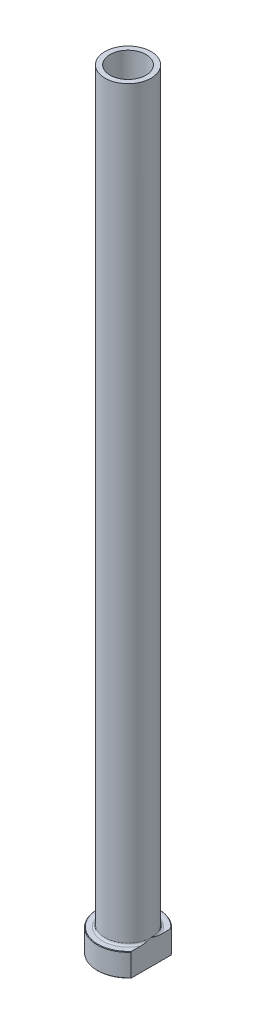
ISO-10303-21;
HEADER;
FILE_DESCRIPTION(('STEP AP214'),'2;1');
FILE_NAME('part.step','',(''),(''),'','','');
FILE_SCHEMA(('AUTOMOTIVE_DESIGN { 1 0 10303 214 1 1 1 1 }'));
ENDSEC;
DATA;
#1=APPLICATION_CONTEXT('core data for automotive mechanical design processes');
#2=APPLICATION_PROTOCOL_DEFINITION('international standard','automotive_design',2000,#1);
#3=PRODUCT_CONTEXT('',#1,'mechanical');
#4=PRODUCT('Part','Part','',(#3));
#5=PRODUCT_RELATED_PRODUCT_CATEGORY('part','',(#4));
#6=PRODUCT_DEFINITION_FORMATION('','',#4);
#7=PRODUCT_DEFINITION_CONTEXT('part definition',#1,'design');
#8=PRODUCT_DEFINITION('design','',#6,#7);
#9=PRODUCT_DEFINITION_SHAPE('','',#8);
#10=(LENGTH_UNIT() NAMED_UNIT(*) SI_UNIT(.MILLI.,.METRE.));
#11=(NAMED_UNIT(*) PLANE_ANGLE_UNIT() SI_UNIT($,.RADIAN.));
#12=(NAMED_UNIT(*) SI_UNIT($,.STERADIAN.) SOLID_ANGLE_UNIT());
#13=UNCERTAINTY_MEASURE_WITH_UNIT(LENGTH_MEASURE(1.E-05),#10,'distance_accuracy_value','');
#14=(GEOMETRIC_REPRESENTATION_CONTEXT(3) GLOBAL_UNCERTAINTY_ASSIGNED_CONTEXT((#13)) GLOBAL_UNIT_ASSIGNED_CONTEXT((#10,
#11,#12)) REPRESENTATION_CONTEXT('',''));
#15=CARTESIAN_POINT('',(0.,0.,0.));
#16=DIRECTION('',(0.,0.,1.));
#17=DIRECTION('',(1.,0.,0.));
#18=AXIS2_PLACEMENT_3D('',#15,#16,#17);
#19=CARTESIAN_POINT('',(0.,92.1876809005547,0.));
#20=DIRECTION('',(0.,1.,0.));
#21=DIRECTION('',(0.,0.,1.));
#22=AXIS2_PLACEMENT_3D('',#19,#20,#21);
#23=CYLINDRICAL_SURFACE('',#22,7.00000000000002);
#24=CARTESIAN_POINT('',(0.,300.,0.));
#25=DIRECTION('',(0.,1.,0.));
#26=DIRECTION('',(0.,0.,1.));
#27=AXIS2_PLACEMENT_3D('',#24,#25,#26);
#28=CIRCLE('',#27,7.00000000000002);
#29=CARTESIAN_POINT('',(0.,300.,7.00000000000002));
#30=VERTEX_POINT('',#29);
#31=EDGE_CURVE('E167',#30,#30,#28,.T.);
#32=ORIENTED_EDGE('',*,*,#31,.T.);
#33=EDGE_LOOP('',(#32));
#34=FACE_BOUND('',#33,.T.);
#35=CARTESIAN_POINT('',(0.,245.,0.));
#36=DIRECTION('',(0.,1.,0.));
#37=DIRECTION('',(0.,0.,1.));
#38=AXIS2_PLACEMENT_3D('',#35,#36,#37);
#39=CIRCLE('',#38,7.00000000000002);
#40=CARTESIAN_POINT('',(0.,245.,7.00000000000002));
#41=VERTEX_POINT('',#40);
#42=EDGE_CURVE('E170',#41,#41,#39,.T.);
#43=ORIENTED_EDGE('',*,*,#42,.F.);
#44=EDGE_LOOP('',(#43));
#45=FACE_BOUND('',#44,.T.);
#46=ADVANCED_FACE('F32',(#34,#45),#23,.F.);
#47=CARTESIAN_POINT('',(-7.00000000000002,300.,0.));
#48=DIRECTION('',(0.,1.,0.));
#49=DIRECTION('',(0.,0.,1.));
#50=AXIS2_PLACEMENT_3D('',#47,#48,#49);
#51=PLANE('',#50);
#52=CARTESIAN_POINT('',(0.,300.,0.));
#53=DIRECTION('',(0.,1.,0.));
#54=DIRECTION('',(0.,0.,1.));
#55=AXIS2_PLACEMENT_3D('',#52,#53,#54);
#56=CIRCLE('',#55,9.00000000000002);
#57=CARTESIAN_POINT('',(0.,300.,9.00000000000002));
#58=VERTEX_POINT('',#57);
#59=EDGE_CURVE('E174',#58,#58,#56,.T.);
#60=ORIENTED_EDGE('',*,*,#59,.T.);
#61=EDGE_LOOP('',(#60));
#62=FACE_BOUND('',#61,.T.);
#63=ORIENTED_EDGE('',*,*,#31,.F.);
#64=EDGE_LOOP('',(#63));
#65=FACE_BOUND('',#64,.T.);
#66=ADVANCED_FACE('F157',(#62,#65),#51,.T.);
#67=CARTESIAN_POINT('',(0.,92.1876809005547,0.));
#68=DIRECTION('',(0.,1.,0.));
#69=DIRECTION('',(0.,0.,1.));
#70=AXIS2_PLACEMENT_3D('',#67,#68,#69);
#71=CYLINDRICAL_SURFACE('',#70,9.00000000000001);
#72=CARTESIAN_POINT('',(0.,9.8,0.));
#73=DIRECTION('',(0.,1.,0.));
#74=DIRECTION('',(0.,0.,1.));
#75=AXIS2_PLACEMENT_3D('',#72,#73,#74);
#76=CIRCLE('',#75,9.00000000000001);
#77=CARTESIAN_POINT('',(9.,9.8,0.));
#78=VERTEX_POINT('',#77);
#79=EDGE_CURVE('E180',#78,#78,#76,.T.);
#80=ORIENTED_EDGE('',*,*,#79,.T.);
#81=EDGE_LOOP('',(#80));
#82=FACE_BOUND('',#81,.T.);
#83=ORIENTED_EDGE('',*,*,#59,.F.);
#84=EDGE_LOOP('',(#83));
#85=FACE_BOUND('',#84,.T.);
#86=ADVANCED_FACE('F162',(#82,#85),#71,.T.);
#87=CARTESIAN_POINT('',(-8.99999999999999,9.,0.));
#88=DIRECTION('',(0.,1.,0.));
#89=DIRECTION('',(0.,0.,1.));
#90=AXIS2_PLACEMENT_3D('',#87,#88,#89);
#91=PLANE('',#90);
#92=DIRECTION('',(0.,0.,1.));
#93=VECTOR('',#92,1.);
#94=CARTESIAN_POINT('',(9.,9.,0.));
#95=LINE('',#94,#93);
#96=CARTESIAN_POINT('',(9.,9.,-7.63151361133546));
#97=VERTEX_POINT('',#96);
#98=CARTESIAN_POINT('',(9.,9.,-3.87814388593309));
#99=VERTEX_POINT('',#98);
#100=EDGE_CURVE('E54',#97,#99,#95,.T.);
#101=ORIENTED_EDGE('',*,*,#100,.F.);
#102=CARTESIAN_POINT('',(0.,9.,0.));
#103=DIRECTION('',(0.,1.,0.));
#104=DIRECTION('',(0.,0.,1.));
#105=AXIS2_PLACEMENT_3D('',#102,#103,#104);
#106=CIRCLE('',#105,11.7999999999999);
#107=CARTESIAN_POINT('',(8.99999999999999,9.,7.63151361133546));
#108=VERTEX_POINT('',#107);
#109=EDGE_CURVE('E186',#97,#108,#106,.T.);
#110=ORIENTED_EDGE('',*,*,#109,.T.);
#111=CARTESIAN_POINT('',(9.,9.,3.87814388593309));
#112=VERTEX_POINT('',#111);
#113=EDGE_CURVE('E134',#112,#108,#95,.T.);
#114=ORIENTED_EDGE('',*,*,#113,.F.);
#115=CARTESIAN_POINT('',(0.,9.,0.));
#116=DIRECTION('',(0.,1.,0.));
#117=DIRECTION('',(0.,0.,1.));
#118=AXIS2_PLACEMENT_3D('',#115,#116,#117);
#119=CIRCLE('',#118,9.80000000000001);
#120=EDGE_CURVE('E183',#112,#99,#119,.F.);
#121=ORIENTED_EDGE('',*,*,#120,.T.);
#122=EDGE_LOOP('',(#101,#110,#114,#121));
#123=FACE_BOUND('',#122,.T.);
#124=ADVANCED_FACE('F197',(#123),#91,.T.);
#125=CARTESIAN_POINT('',(0.,92.1876809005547,0.));
#126=DIRECTION('',(0.,1.,0.));
#127=DIRECTION('',(0.,0.,1.));
#128=AXIS2_PLACEMENT_3D('',#125,#126,#127);
#129=CYLINDRICAL_SURFACE('',#128,12.);
#130=DIRECTION('',(0.,-1.,0.));
#131=VECTOR('',#130,1.);
#132=CARTESIAN_POINT('',(8.99999999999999,300.,7.93725393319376));
#133=LINE('',#132,#131);
#134=CARTESIAN_POINT('',(8.99999999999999,8.79999999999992,7.93725393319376));
#135=VERTEX_POINT('',#134);
#136=CARTESIAN_POINT('',(8.99999999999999,0.200000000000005,7.93725393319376));
#137=VERTEX_POINT('',#136);
#138=EDGE_CURVE('E82',#135,#137,#133,.T.);
#139=ORIENTED_EDGE('',*,*,#138,.F.);
#140=CARTESIAN_POINT('',(0.,8.79999999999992,0.));
#141=DIRECTION('',(0.,1.,0.));
#142=DIRECTION('',(0.,0.,1.));
#143=AXIS2_PLACEMENT_3D('',#140,#141,#142);
#144=CIRCLE('',#143,12.);
#145=CARTESIAN_POINT('',(9.,8.79999999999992,-7.93725393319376));
#146=VERTEX_POINT('',#145);
#147=EDGE_CURVE('E95',#135,#146,#144,.F.);
#148=ORIENTED_EDGE('',*,*,#147,.T.);
#149=DIRECTION('',(0.,-1.,0.));
#150=VECTOR('',#149,1.);
#151=CARTESIAN_POINT('',(9.,300.,-7.93725393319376));
#152=LINE('',#151,#150);
#153=CARTESIAN_POINT('',(9.,0.200000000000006,-7.93725393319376));
#154=VERTEX_POINT('',#153);
#155=EDGE_CURVE('E192',#146,#154,#152,.T.);
#156=ORIENTED_EDGE('',*,*,#155,.T.);
#157=CARTESIAN_POINT('',(0.,0.200000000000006,0.));
#158=DIRECTION('',(0.,-1.,0.));
#159=DIRECTION('',(0.,0.,-1.));
#160=AXIS2_PLACEMENT_3D('',#157,#158,#159);
#161=CIRCLE('',#160,12.);
#162=EDGE_CURVE('E98',#154,#137,#161,.F.);
#163=ORIENTED_EDGE('',*,*,#162,.T.);
#164=EDGE_LOOP('',(#139,#148,#156,#163));
#165=FACE_BOUND('',#164,.T.);
#166=ADVANCED_FACE('F190',(#165),#129,.T.);
#167=CARTESIAN_POINT('',(-12.,0.,0.));
#168=DIRECTION('',(0.,-1.,0.));
#169=DIRECTION('',(0.,0.,-1.));
#170=AXIS2_PLACEMENT_3D('',#167,#168,#169);
#171=PLANE('',#170);
#172=CARTESIAN_POINT('',(0.,0.,0.));
#173=DIRECTION('',(0.,-1.,0.));
#174=DIRECTION('',(0.,0.,-1.));
#175=AXIS2_PLACEMENT_3D('',#172,#173,#174);
#176=CIRCLE('',#175,7.74999999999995);
#177=CARTESIAN_POINT('',(0.,0.,-7.74999999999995));
#178=VERTEX_POINT('',#177);
#179=EDGE_CURVE('E40',#178,#178,#176,.F.);
#180=ORIENTED_EDGE('',*,*,#179,.T.);
#181=EDGE_LOOP('',(#180));
#182=FACE_BOUND('',#181,.T.);
#183=DIRECTION('',(0.,0.,-1.));
#184=VECTOR('',#183,1.);
#185=CARTESIAN_POINT('',(8.99999999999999,0.,7.93725393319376));
#186=LINE('',#185,#184);
#187=CARTESIAN_POINT('',(8.99999999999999,0.,7.63151361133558));
#188=VERTEX_POINT('',#187);
#189=CARTESIAN_POINT('',(9.,0.,-7.63151361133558));
#190=VERTEX_POINT('',#189);
#191=EDGE_CURVE('E47',#188,#190,#186,.T.);
#192=ORIENTED_EDGE('',*,*,#191,.F.);
#193=CARTESIAN_POINT('',(0.,0.,0.));
#194=DIRECTION('',(0.,-1.,0.));
#195=DIRECTION('',(0.,0.,-1.));
#196=AXIS2_PLACEMENT_3D('',#193,#194,#195);
#197=CIRCLE('',#196,11.8);
#198=EDGE_CURVE('E92',#188,#190,#197,.T.);
#199=ORIENTED_EDGE('',*,*,#198,.T.);
#200=EDGE_LOOP('',(#192,#199));
#201=FACE_BOUND('',#200,.T.);
#202=ADVANCED_FACE('F91',(#182,#201),#171,.T.);
#203=CARTESIAN_POINT('',(0.,92.1876809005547,0.));
#204=DIRECTION('',(0.,1.,0.));
#205=DIRECTION('',(0.,0.,1.));
#206=AXIS2_PLACEMENT_3D('',#203,#204,#205);
#207=CYLINDRICAL_SURFACE('',#206,7.25);
#208=CARTESIAN_POINT('',(0.,0.499999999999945,0.));
#209=DIRECTION('',(0.,-1.,0.));
#210=DIRECTION('',(0.,0.,-1.));
#211=AXIS2_PLACEMENT_3D('',#208,#209,#210);
#212=CIRCLE('',#211,7.25);
#213=CARTESIAN_POINT('',(0.,0.499999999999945,-7.25));
#214=VERTEX_POINT('',#213);
#215=EDGE_CURVE('E11',#214,#214,#212,.T.);
#216=ORIENTED_EDGE('',*,*,#215,.T.);
#217=EDGE_LOOP('',(#216));
#218=FACE_BOUND('',#217,.T.);
#219=CARTESIAN_POINT('',(0.,233.,0.));
#220=DIRECTION('',(0.,1.,0.));
#221=DIRECTION('',(0.,0.,1.));
#222=AXIS2_PLACEMENT_3D('',#219,#220,#221);
#223=CIRCLE('',#222,7.25000000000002);
#224=CARTESIAN_POINT('',(0.,233.,7.25000000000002));
#225=VERTEX_POINT('',#224);
#226=EDGE_CURVE('E172',#225,#225,#223,.T.);
#227=ORIENTED_EDGE('',*,*,#226,.T.);
#228=EDGE_LOOP('',(#227));
#229=FACE_BOUND('',#228,.T.);
#230=ADVANCED_FACE('F215',(#218,#229),#207,.F.);
#231=CARTESIAN_POINT('',(0.,233.,0.));
#232=DIRECTION('',(0.,-1.,0.));
#233=DIRECTION('',(0.,0.,-1.));
#234=AXIS2_PLACEMENT_3D('',#231,#232,#233);
#235=CONICAL_SURFACE('',#234,7.25000000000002,0.0208303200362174);
#236=ORIENTED_EDGE('',*,*,#42,.T.);
#237=EDGE_LOOP('',(#236));
#238=FACE_BOUND('',#237,.T.);
#239=ORIENTED_EDGE('',*,*,#226,.F.);
#240=EDGE_LOOP('',(#239));
#241=FACE_BOUND('',#240,.T.);
#242=ADVANCED_FACE('F111',(#238,#241),#235,.F.);
#243=CARTESIAN_POINT('',(0.,9.8,0.));
#244=DIRECTION('',(0.,1.,0.));
#245=DIRECTION('',(0.,0.,1.));
#246=AXIS2_PLACEMENT_3D('',#243,#244,#245);
#247=TOROIDAL_SURFACE('',#246,9.80000000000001,0.8);
#248=ORIENTED_EDGE('',*,*,#120,.F.);
#249=CARTESIAN_POINT('',(9.,9.8,0.));
#250=CARTESIAN_POINT('',(9.,9.80000101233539,-6.4683805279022E-11));
#251=CARTESIAN_POINT('',(9.,9.80000202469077,3.17332584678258E-07));
#252=CARTESIAN_POINT('',(9.,9.80000393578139,1.24154750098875E-06));
#253=CARTESIAN_POINT('',(9.,9.80000482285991,1.86583060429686E-06));
#254=CARTESIAN_POINT('',(9.,9.80000663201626,3.35641339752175E-06));
#255=CARTESIAN_POINT('',(9.,9.80000753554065,4.24567417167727E-06));
#256=CARTESIAN_POINT('',(9.,9.80000918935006,6.11612227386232E-06));
#257=CARTESIAN_POINT('',(9.,9.80000994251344,7.09492055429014E-06));
#258=CARTESIAN_POINT('',(9.,9.80001263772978,1.0780271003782E-05));
#259=CARTESIAN_POINT('',(9.,9.80001442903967,1.36008599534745E-05));
#260=CARTESIAN_POINT('',(9.,9.80001746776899,1.92722544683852E-05));
#261=CARTESIAN_POINT('',(9.,9.80001874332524,2.21087228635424E-05));
#262=CARTESIAN_POINT('',(9.,9.80002390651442,3.37975055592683E-05));
#263=CARTESIAN_POINT('',(9.,9.80002763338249,4.27293190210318E-05));
#264=CARTESIAN_POINT('',(9.,9.80003330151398,5.98324831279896E-05));
#265=CARTESIAN_POINT('',(9.,9.80003541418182,6.79472980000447E-05));
#266=CARTESIAN_POINT('',(9.00000000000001,9.80005049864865,0.000127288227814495));
#267=CARTESIAN_POINT('',(9.,9.80006163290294,0.000178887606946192));
#268=CARTESIAN_POINT('',(8.99999999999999,9.800110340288,0.000381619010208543));
#269=CARTESIAN_POINT('',(8.99999999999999,9.8001571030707,0.000530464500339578));
#270=CARTESIAN_POINT('',(9.00000000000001,9.80033804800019,0.00111728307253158));
#271=CARTESIAN_POINT('',(9.,9.80046603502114,0.00155660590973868));
#272=CARTESIAN_POINT('',(8.99999999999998,9.80097635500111,0.00329406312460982));
#273=CARTESIAN_POINT('',(8.99999999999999,9.8013663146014,0.00459050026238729));
#274=CARTESIAN_POINT('',(9.00000000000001,9.80298403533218,0.00998416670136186));
#275=CARTESIAN_POINT('',(9.00000000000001,9.80420236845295,0.014083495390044));
#276=CARTESIAN_POINT('',(8.99999999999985,9.82648661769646,0.0890427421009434));
#277=CARTESIAN_POINT('',(8.99999999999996,9.8476462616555,0.159882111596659));
#278=CARTESIAN_POINT('',(9.00000000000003,9.8889590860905,0.298764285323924));
#279=CARTESIAN_POINT('',(9.00000000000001,9.90911860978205,0.366805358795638));
#280=CARTESIAN_POINT('',(8.99999999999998,9.95179311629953,0.51152451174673));
#281=CARTESIAN_POINT('',(8.99999999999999,9.97428452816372,0.588209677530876));
#282=CARTESIAN_POINT('',(9.,10.0191408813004,0.742532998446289));
#283=CARTESIAN_POINT('',(9.,10.0415017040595,0.820172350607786));
#284=CARTESIAN_POINT('',(9.,10.0794112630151,0.953448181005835));
#285=CARTESIAN_POINT('',(9.,10.0950851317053,1.00904901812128));
#286=CARTESIAN_POINT('',(9.,10.1260784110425,1.1201953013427));
#287=CARTESIAN_POINT('',(9.,10.1413986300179,1.17574052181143));
#288=CARTESIAN_POINT('',(9.,10.1860703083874,1.33980716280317));
#289=CARTESIAN_POINT('',(9.,10.2149083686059,1.4484686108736));
#290=CARTESIAN_POINT('',(9.,10.2856369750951,1.7241783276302));
#291=CARTESIAN_POINT('',(9.,10.3263124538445,1.89154391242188));
#292=CARTESIAN_POINT('',(9.,10.4020454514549,2.22904779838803));
#293=CARTESIAN_POINT('',(9.,10.4370523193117,2.39919757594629));
#294=CARTESIAN_POINT('',(9.,10.5014391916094,2.75494052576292));
#295=CARTESIAN_POINT('',(9.,10.5301301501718,2.94066439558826));
#296=CARTESIAN_POINT('',(9.,10.5633122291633,3.22016202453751));
#297=CARTESIAN_POINT('',(9.,10.5727244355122,3.31335338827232));
#298=CARTESIAN_POINT('',(9.,10.5877042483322,3.50003892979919));
#299=CARTESIAN_POINT('',(9.,10.5932725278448,3.59353305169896));
#300=CARTESIAN_POINT('',(9.,10.5997812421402,3.77831079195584));
#301=CARTESIAN_POINT('',(9.,10.6008358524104,3.86959010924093));
#302=CARTESIAN_POINT('',(9.,10.5977997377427,4.0521529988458));
#303=CARTESIAN_POINT('',(8.99999999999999,10.5937049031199,4.14343651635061));
#304=CARTESIAN_POINT('',(8.99999999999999,10.579384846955,4.32415905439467));
#305=CARTESIAN_POINT('',(8.99999999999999,10.5692536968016,4.41360502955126));
#306=CARTESIAN_POINT('',(8.99999999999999,10.5415393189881,4.59125765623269));
#307=CARTESIAN_POINT('',(8.99999999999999,10.5239649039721,4.67946564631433));
#308=CARTESIAN_POINT('',(8.99999999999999,10.4790565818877,4.85471882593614));
#309=CARTESIAN_POINT('',(8.99999999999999,10.4516029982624,4.94173554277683));
#310=CARTESIAN_POINT('',(8.99999999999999,10.4007972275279,5.06830195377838));
#311=CARTESIAN_POINT('',(8.99999999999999,10.3822808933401,5.10979172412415));
#312=CARTESIAN_POINT('',(8.99999999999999,10.3414775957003,5.19085457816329));
#313=CARTESIAN_POINT('',(8.99999999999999,10.3191952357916,5.23042992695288));
#314=CARTESIAN_POINT('',(8.99999999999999,10.2750362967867,5.29920261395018));
#315=CARTESIAN_POINT('',(8.99999999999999,10.2539514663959,5.32890420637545));
#316=CARTESIAN_POINT('',(8.99999999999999,10.2085010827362,5.38577147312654));
#317=CARTESIAN_POINT('',(8.99999999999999,10.1841327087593,5.41293493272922));
#318=CARTESIAN_POINT('',(8.99999999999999,10.1314615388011,5.46389233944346));
#319=CARTESIAN_POINT('',(8.99999999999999,10.1031152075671,5.4876421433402));
#320=CARTESIAN_POINT('',(8.99999999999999,10.0426124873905,5.52966859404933));
#321=CARTESIAN_POINT('',(8.99999999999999,10.010467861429,5.54796155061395));
#322=CARTESIAN_POINT('',(8.99999999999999,9.95377518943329,5.57238639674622));
#323=CARTESIAN_POINT('',(8.99999999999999,9.93009823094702,5.58053697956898));
#324=CARTESIAN_POINT('',(8.99999999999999,9.88171464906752,5.59278453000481));
#325=CARTESIAN_POINT('',(8.99999999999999,9.85700894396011,5.59688503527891));
#326=CARTESIAN_POINT('',(8.99999999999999,9.80717489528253,5.60067699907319));
#327=CARTESIAN_POINT('',(8.99999999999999,9.78204544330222,5.60035415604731));
#328=CARTESIAN_POINT('',(8.99999999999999,9.73223420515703,5.59529565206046));
#329=CARTESIAN_POINT('',(8.99999999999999,9.70755259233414,5.59055831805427));
#330=CARTESIAN_POINT('',(8.99999999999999,9.66020362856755,5.57733425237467));
#331=CARTESIAN_POINT('',(8.99999999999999,9.63749568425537,5.5689898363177));
#332=CARTESIAN_POINT('',(8.99999999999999,9.59351516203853,5.54915687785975));
#333=CARTESIAN_POINT('',(8.99999999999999,9.57224307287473,5.53766727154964));
#334=CARTESIAN_POINT('',(8.99999999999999,9.51928150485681,5.50462580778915));
#335=CARTESIAN_POINT('',(8.99999999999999,9.48880776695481,5.48112661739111));
#336=CARTESIAN_POINT('',(8.99999999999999,9.43189052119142,5.42965338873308));
#337=CARTESIAN_POINT('',(8.99999999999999,9.40546009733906,5.40166539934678));
#338=CARTESIAN_POINT('',(8.99999999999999,9.3400555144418,5.32319042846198));
#339=CARTESIAN_POINT('',(8.99999999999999,9.30430472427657,5.2700386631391));
#340=CARTESIAN_POINT('',(8.99999999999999,9.24095813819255,5.1592639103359));
#341=CARTESIAN_POINT('',(8.99999999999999,9.21336826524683,5.10163771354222));
#342=CARTESIAN_POINT('',(8.99999999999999,9.16551403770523,4.98579619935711));
#343=CARTESIAN_POINT('',(8.99999999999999,9.1450293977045,4.92767012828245));
#344=CARTESIAN_POINT('',(8.99999999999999,9.10900516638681,4.80987690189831));
#345=CARTESIAN_POINT('',(8.99999999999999,9.0934705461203,4.75020826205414));
#346=CARTESIAN_POINT('',(8.99999999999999,9.06639912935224,4.62926355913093));
#347=CARTESIAN_POINT('',(8.99999999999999,9.05491059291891,4.56797688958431));
#348=CARTESIAN_POINT('',(8.99999999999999,9.03554988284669,4.44488746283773));
#349=CARTESIAN_POINT('',(8.99999999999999,9.02767548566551,4.38308504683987));
#350=CARTESIAN_POINT('',(8.99999999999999,9.01237706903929,4.23320098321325));
#351=CARTESIAN_POINT('',(8.99999999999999,9.00652460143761,4.14495990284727));
#352=CARTESIAN_POINT('',(8.99999999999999,8.99996624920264,3.9682712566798));
#353=CARTESIAN_POINT('',(9.,8.99926276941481,3.87982361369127));
#354=CARTESIAN_POINT('',(9.,9.00218728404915,3.70272096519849));
#355=CARTESIAN_POINT('',(9.,9.00582939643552,3.6140662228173));
#356=CARTESIAN_POINT('',(9.,9.01681466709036,3.43698088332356));
#357=CARTESIAN_POINT('',(9.,9.02415848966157,3.34855032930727));
#358=CARTESIAN_POINT('',(9.,9.04989749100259,3.09391807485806));
#359=CARTESIAN_POINT('',(9.,9.0723219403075,2.92812217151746));
#360=CARTESIAN_POINT('',(9.,9.12539895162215,2.59921508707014));
#361=CARTESIAN_POINT('',(9.,9.1559872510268,2.43609307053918));
#362=CARTESIAN_POINT('',(9.,9.22330285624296,2.11182788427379));
#363=CARTESIAN_POINT('',(9.,9.26000471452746,1.95067936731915));
#364=CARTESIAN_POINT('',(9.,9.31897632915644,1.70786584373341));
#365=CARTESIAN_POINT('',(9.,9.33955107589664,1.62578051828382));
#366=CARTESIAN_POINT('',(9.,9.38177259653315,1.46165638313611));
#367=CARTESIAN_POINT('',(9.,9.40342203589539,1.37961825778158));
#368=CARTESIAN_POINT('',(9.,9.45602430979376,1.18435079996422));
#369=CARTESIAN_POINT('',(9.,9.48736095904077,1.07122519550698));
#370=CARTESIAN_POINT('',(9.,9.55083956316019,0.846545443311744));
#371=CARTESIAN_POINT('',(9.,9.58296886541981,0.734987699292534));
#372=CARTESIAN_POINT('',(9.,9.64431039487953,0.524609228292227));
#373=CARTESIAN_POINT('',(9.,9.67344475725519,0.42576576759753));
#374=CARTESIAN_POINT('',(9.,9.71808680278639,0.275077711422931));
#375=CARTESIAN_POINT('',(8.99999999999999,9.73349584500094,0.223203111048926));
#376=CARTESIAN_POINT('',(9.,9.76415269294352,0.120285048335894));
#377=CARTESIAN_POINT('',(9.00000000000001,9.77939925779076,0.0692412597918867));
#378=CARTESIAN_POINT('',(9.,9.79579831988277,0.0140813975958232));
#379=CARTESIAN_POINT('',(8.99999999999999,9.79701722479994,0.00997994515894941));
#380=CARTESIAN_POINT('',(9.,9.79863508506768,0.00458578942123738));
#381=CARTESIAN_POINT('',(9.,9.79902455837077,0.00329097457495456));
#382=CARTESIAN_POINT('',(9.,9.79953428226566,0.00155554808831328));
#383=CARTESIAN_POINT('',(8.99999999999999,9.79966215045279,0.00111663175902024));
#384=CARTESIAN_POINT('',(9.,9.79984295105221,0.000530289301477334));
#385=CARTESIAN_POINT('',(9.,9.7998896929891,0.000381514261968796));
#386=CARTESIAN_POINT('',(9.,9.79993838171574,0.000178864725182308));
#387=CARTESIAN_POINT('',(9.,9.79994951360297,0.000127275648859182));
#388=CARTESIAN_POINT('',(9.,9.79996459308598,6.7945137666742E-05));
#389=CARTESIAN_POINT('',(9.,9.79996670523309,5.98309339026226E-05));
#390=CARTESIAN_POINT('',(9.,9.79997237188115,4.27289867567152E-05));
#391=CARTESIAN_POINT('',(9.,9.79997609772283,3.37977473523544E-05));
#392=CARTESIAN_POINT('',(9.,9.79998125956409,2.21095467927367E-05));
#393=CARTESIAN_POINT('',(9.,9.79998253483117,1.92731239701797E-05));
#394=CARTESIAN_POINT('',(9.,9.79998557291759,1.36017696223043E-05));
#395=CARTESIAN_POINT('',(9.,9.79998736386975,1.07811702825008E-05));
#396=CARTESIAN_POINT('',(9.,9.79999005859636,7.09574547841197E-06));
#397=CARTESIAN_POINT('',(9.,9.79999081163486,6.11691225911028E-06));
#398=CARTESIAN_POINT('',(9.,9.79999246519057,4.2463717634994E-06));
#399=CARTESIAN_POINT('',(9.,9.79999336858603,3.35705295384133E-06));
#400=CARTESIAN_POINT('',(9.,9.79999517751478,1.86633217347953E-06));
#401=CARTESIAN_POINT('',(9.,9.79999606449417,1.24197357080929E-06));
#402=CARTESIAN_POINT('',(9.,9.79999797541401,3.17571007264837E-07));
#403=CARTESIAN_POINT('',(9.,9.79999898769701,6.46856694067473E-11));
#404=CARTESIAN_POINT('',(9.,9.8,0.));
#405=B_SPLINE_CURVE_WITH_KNOTS('',3,(#249,#250,#251,#252,#253,#254,#255,#256,#257,#258,#259,
#260,#261,#262,#263,#264,#265,#266,#267,#268,#269,#270,#271,#272,#273,#274,#275,#276,#277,#278,
#279,#280,#281,#282,#283,#284,#285,#286,#287,#288,#289,#290,#291,#292,#293,#294,#295,#296,#297,
#298,#299,#300,#301,#302,#303,#304,#305,#306,#307,#308,#309,#310,#311,#312,#313,#314,#315,#316,
#317,#318,#319,#320,#321,#322,#323,#324,#325,#326,#327,#328,#329,#330,#331,#332,#333,#334,#335,
#336,#337,#338,#339,#340,#341,#342,#343,#344,#345,#346,#347,#348,#349,#350,#351,#352,#353,#354,
#355,#356,#357,#358,#359,#360,#361,#362,#363,#364,#365,#366,#367,#368,#369,#370,#371,#372,#373,
#374,#375,#376,#377,#378,#379,#380,#381,#382,#383,#384,#385,#386,#387,#388,#389,#390,#391,#392,
#393,#394,#395,#396,#397,#398,#399,#400,#401,#402,#403,#404),.UNSPECIFIED.,.T.,.F.,(4,2,2,2,2,2,
2,2,2,2,2,2,2,2,2,2,2,2,2,2,2,2,2,2,2,2,2,2,2,2,2,2,2,2,2,2,2,2,2,2,2,2,2,2,2,2,2,2,2,2,2,2,2,2,
2,2,2,2,2,2,2,2,2,2,2,2,2,2,2,2,2,2,2,2,2,2,2,4),(0.,3.04771521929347E-06,6.29345989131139E-06,
1.00769836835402E-05,1.37791162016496E-05,2.37619313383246E-05,3.30844836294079E-05,
6.20551971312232E-05,8.71785063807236E-05,0.000245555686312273,0.000713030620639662,
0.00208637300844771,0.00614710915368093,0.0189775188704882,0.240764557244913,0.453660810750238,
0.693405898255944,0.935790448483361,1.10909318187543,1.28194996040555,1.61921055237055,
2.13583880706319,2.6568550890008,3.22023907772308,3.50117319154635,3.7820581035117,
4.05579427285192,4.32974904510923,4.59954218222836,4.86901677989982,5.1418722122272,
5.27802968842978,5.4140219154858,5.52311134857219,5.63229509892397,5.74278355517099,
5.85293838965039,5.92775570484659,6.00250761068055,6.07750126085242,6.15252334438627,
6.22482267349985,6.29714648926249,6.41192958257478,6.52707659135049,6.71816463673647,
6.90939103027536,7.09400621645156,7.27880622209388,7.46574121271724,7.6525610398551,
7.91766914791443,8.18290106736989,8.44899702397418,8.71514075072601,9.21672782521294,
9.71447745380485,10.2102047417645,10.4640739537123,10.7186077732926,11.0707555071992,
11.4190290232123,11.7281703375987,11.8905163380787,12.0503265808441,12.0631635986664,
12.0672192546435,12.068591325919,12.0690585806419,12.0692169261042,12.0692420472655,
12.0692710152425,12.0692803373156,12.0692903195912,12.0692940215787,12.0692978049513,
12.0693010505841,12.0693040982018),.UNSPECIFIED.);
#406=EDGE_CURVE('E126',#112,#78,#405,.T.);
#407=ORIENTED_EDGE('',*,*,#406,.T.);
#408=ORIENTED_EDGE('',*,*,#79,.F.);
#409=CARTESIAN_POINT('',(9.,9.8,0.));
#410=CARTESIAN_POINT('',(9.,9.79999898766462,6.46874608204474E-11));
#411=CARTESIAN_POINT('',(9.,9.79999797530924,-3.1733258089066E-07));
#412=CARTESIAN_POINT('',(9.,9.79999606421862,-1.24154749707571E-06));
#413=CARTESIAN_POINT('',(9.,9.79999517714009,-1.8658306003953E-06));
#414=CARTESIAN_POINT('',(9.,9.79999336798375,-3.35641339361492E-06));
#415=CARTESIAN_POINT('',(9.,9.79999246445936,-4.24567416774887E-06));
#416=CARTESIAN_POINT('',(9.,9.79999081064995,-6.11612226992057E-06));
#417=CARTESIAN_POINT('',(9.,9.79999005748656,-7.09492055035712E-06));
#418=CARTESIAN_POINT('',(9.,9.79998736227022,-1.07802709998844E-05));
#419=CARTESIAN_POINT('',(9.,9.79998557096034,-1.3600859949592E-05));
#420=CARTESIAN_POINT('',(9.,9.79998253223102,-1.92722544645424E-05));
#421=CARTESIAN_POINT('',(9.,9.79998125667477,-2.21087228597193E-05));
#422=CARTESIAN_POINT('',(9.,9.79997609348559,-3.37975055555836E-05));
#423=CARTESIAN_POINT('',(9.,9.79997236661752,-4.27293190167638E-05));
#424=CARTESIAN_POINT('',(9.,9.79996669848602,-5.98324831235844E-05));
#425=CARTESIAN_POINT('',(9.,9.79996458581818,-6.79472979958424E-05));
#426=CARTESIAN_POINT('',(9.,9.79994950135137,-0.000127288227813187));
#427=CARTESIAN_POINT('',(9.,9.79993836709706,-0.000178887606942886));
#428=CARTESIAN_POINT('',(9.,9.79988965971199,-0.000381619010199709));
#429=CARTESIAN_POINT('',(9.,9.7998428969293,-0.000530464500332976));
#430=CARTESIAN_POINT('',(8.99999999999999,9.79966195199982,-0.00111728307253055));
#431=CARTESIAN_POINT('',(9.,9.79953396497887,-0.00155660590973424));
#432=CARTESIAN_POINT('',(9.,9.79902364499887,-0.00329406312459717));
#433=CARTESIAN_POINT('',(9.,9.79863368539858,-0.00459050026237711));
#434=CARTESIAN_POINT('',(8.99999999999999,9.79701596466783,-0.00998416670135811));
#435=CARTESIAN_POINT('',(9.,9.79579763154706,-0.01408349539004));
#436=CARTESIAN_POINT('',(9.00000000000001,9.77351338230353,-0.0890427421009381));
#437=CARTESIAN_POINT('',(9.,9.7523537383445,-0.159882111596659));
#438=CARTESIAN_POINT('',(8.99999999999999,9.71104091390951,-0.298764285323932));
#439=CARTESIAN_POINT('',(9.,9.69088139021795,-0.36680535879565));
#440=CARTESIAN_POINT('',(9.,9.64820688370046,-0.511524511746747));
#441=CARTESIAN_POINT('',(9.,9.62571547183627,-0.588209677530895));
#442=CARTESIAN_POINT('',(9.,9.58085911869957,-0.74253299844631));
#443=CARTESIAN_POINT('',(9.,9.55849829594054,-0.820172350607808));
#444=CARTESIAN_POINT('',(9.,9.52058873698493,-0.953448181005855));
#445=CARTESIAN_POINT('',(9.,9.50491486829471,-1.0090490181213));
#446=CARTESIAN_POINT('',(9.,9.47392158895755,-1.12019530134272));
#447=CARTESIAN_POINT('',(9.,9.45860136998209,-1.17574052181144));
#448=CARTESIAN_POINT('',(9.,9.41392969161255,-1.33980716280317));
#449=CARTESIAN_POINT('',(9.,9.38509163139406,-1.4484686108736));
#450=CARTESIAN_POINT('',(9.,9.3143630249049,-1.7241783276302));
#451=CARTESIAN_POINT('',(9.,9.27368754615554,-1.89154391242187));
#452=CARTESIAN_POINT('',(9.,9.19795454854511,-2.22904779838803));
#453=CARTESIAN_POINT('',(9.,9.1629476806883,-2.39919757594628));
#454=CARTESIAN_POINT('',(9.,9.09856080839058,-2.75494052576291));
#455=CARTESIAN_POINT('',(9.,9.06986984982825,-2.94066439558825));
#456=CARTESIAN_POINT('',(9.,9.0366877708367,-3.2201620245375));
#457=CARTESIAN_POINT('',(9.,9.02727556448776,-3.31335338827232));
#458=CARTESIAN_POINT('',(9.,9.01229575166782,-3.50003892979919));
#459=CARTESIAN_POINT('',(9.,9.00672747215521,-3.59353305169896));
#460=CARTESIAN_POINT('',(9.,9.00021875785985,-3.77831079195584));
#461=CARTESIAN_POINT('',(9.,8.99916414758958,-3.86959010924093));
#462=CARTESIAN_POINT('',(9.,9.0022002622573,-4.0521529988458));
#463=CARTESIAN_POINT('',(9.,9.00629509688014,-4.14343651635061));
#464=CARTESIAN_POINT('',(9.,9.02061515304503,-4.32415905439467));
#465=CARTESIAN_POINT('',(9.,9.03074630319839,-4.41360502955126));
#466=CARTESIAN_POINT('',(9.,9.05846068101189,-4.59125765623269));
#467=CARTESIAN_POINT('',(9.,9.07603509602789,-4.67946564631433));
#468=CARTESIAN_POINT('',(9.,9.12094341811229,-4.85471882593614));
#469=CARTESIAN_POINT('',(9.,9.14839700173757,-4.94173554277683));
#470=CARTESIAN_POINT('',(9.,9.19920277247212,-5.06830195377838));
#471=CARTESIAN_POINT('',(9.,9.21771910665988,-5.10979172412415));
#472=CARTESIAN_POINT('',(9.,9.25852240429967,-5.19085457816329));
#473=CARTESIAN_POINT('',(9.,9.28080476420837,-5.23042992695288));
#474=CARTESIAN_POINT('',(9.,9.32496370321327,-5.29920261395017));
#475=CARTESIAN_POINT('',(9.,9.34604853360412,-5.32890420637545));
#476=CARTESIAN_POINT('',(9.,9.39149891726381,-5.38577147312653));
#477=CARTESIAN_POINT('',(9.,9.41586729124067,-5.41293493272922));
#478=CARTESIAN_POINT('',(9.,9.46853846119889,-5.46389233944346));
#479=CARTESIAN_POINT('',(9.,9.49688479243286,-5.4876421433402));
#480=CARTESIAN_POINT('',(9.,9.55738751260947,-5.52966859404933));
#481=CARTESIAN_POINT('',(9.,9.58953213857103,-5.54796155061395));
#482=CARTESIAN_POINT('',(9.,9.64622481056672,-5.57238639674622));
#483=CARTESIAN_POINT('',(9.,9.66990176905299,-5.58053697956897));
#484=CARTESIAN_POINT('',(9.,9.71828535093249,-5.59278453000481));
#485=CARTESIAN_POINT('',(9.,9.74299105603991,-5.59688503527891));
#486=CARTESIAN_POINT('',(9.,9.79282510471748,-5.60067699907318));
#487=CARTESIAN_POINT('',(9.,9.81795455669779,-5.6003541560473));
#488=CARTESIAN_POINT('',(9.,9.86776579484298,-5.59529565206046));
#489=CARTESIAN_POINT('',(9.,9.89244740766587,-5.59055831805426));
#490=CARTESIAN_POINT('',(9.,9.93979637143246,-5.57733425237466));
#491=CARTESIAN_POINT('',(9.,9.96250431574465,-5.56898983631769));
#492=CARTESIAN_POINT('',(9.,10.0064848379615,-5.54915687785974));
#493=CARTESIAN_POINT('',(9.,10.0277569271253,-5.53766727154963));
#494=CARTESIAN_POINT('',(9.,10.0807184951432,-5.50462580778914));
#495=CARTESIAN_POINT('',(9.,10.1111922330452,-5.4811266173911));
#496=CARTESIAN_POINT('',(9.,10.1681094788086,-5.42965338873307));
#497=CARTESIAN_POINT('',(9.,10.194539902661,-5.40166539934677));
#498=CARTESIAN_POINT('',(9.,10.2599444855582,-5.32319042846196));
#499=CARTESIAN_POINT('',(9.,10.2956952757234,-5.27003866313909));
#500=CARTESIAN_POINT('',(9.,10.3590418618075,-5.15926391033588));
#501=CARTESIAN_POINT('',(9.,10.3866317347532,-5.1016377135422));
#502=CARTESIAN_POINT('',(9.,10.4344859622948,-4.98579619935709));
#503=CARTESIAN_POINT('',(9.,10.4549706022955,-4.92767012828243));
#504=CARTESIAN_POINT('',(9.,10.4909948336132,-4.80987690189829));
#505=CARTESIAN_POINT('',(9.,10.5065294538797,-4.75020826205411));
#506=CARTESIAN_POINT('',(9.,10.5336008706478,-4.6292635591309));
#507=CARTESIAN_POINT('',(9.,10.5450894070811,-4.56797688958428));
#508=CARTESIAN_POINT('',(9.,10.5644501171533,-4.44488746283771));
#509=CARTESIAN_POINT('',(9.,10.5723245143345,-4.38308504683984));
#510=CARTESIAN_POINT('',(9.,10.5876229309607,-4.23320098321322));
#511=CARTESIAN_POINT('',(9.,10.5934753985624,-4.14495990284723));
#512=CARTESIAN_POINT('',(9.,10.6000337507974,-3.96827125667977));
#513=CARTESIAN_POINT('',(9.,10.6007372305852,-3.87982361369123));
#514=CARTESIAN_POINT('',(9.,10.5978127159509,-3.70272096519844));
#515=CARTESIAN_POINT('',(9.,10.5941706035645,-3.61406622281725));
#516=CARTESIAN_POINT('',(9.,10.5831853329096,-3.43698088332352));
#517=CARTESIAN_POINT('',(9.,10.5758415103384,-3.34855032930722));
#518=CARTESIAN_POINT('',(9.,10.5501025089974,-3.09391807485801));
#519=CARTESIAN_POINT('',(9.,10.5276780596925,-2.92812217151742));
#520=CARTESIAN_POINT('',(9.,10.4746010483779,-2.5992150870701));
#521=CARTESIAN_POINT('',(9.,10.4440127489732,-2.43609307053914));
#522=CARTESIAN_POINT('',(9.,10.376697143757,-2.11182788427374));
#523=CARTESIAN_POINT('',(9.,10.3399952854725,-1.9506793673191));
#524=CARTESIAN_POINT('',(9.,10.2810236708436,-1.70786584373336));
#525=CARTESIAN_POINT('',(9.,10.2604489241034,-1.62578051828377));
#526=CARTESIAN_POINT('',(9.,10.2182274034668,-1.46165638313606));
#527=CARTESIAN_POINT('',(9.,10.1965779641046,-1.37961825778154));
#528=CARTESIAN_POINT('',(9.,10.1439756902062,-1.18435079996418));
#529=CARTESIAN_POINT('',(9.,10.1126390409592,-1.07122519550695));
#530=CARTESIAN_POINT('',(9.,10.0491604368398,-0.846545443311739));
#531=CARTESIAN_POINT('',(9.,10.0170311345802,-0.734987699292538));
#532=CARTESIAN_POINT('',(9.,9.95568960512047,-0.524609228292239));
#533=CARTESIAN_POINT('',(9.,9.9265552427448,-0.425765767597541));
#534=CARTESIAN_POINT('',(9.,9.88191319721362,-0.275077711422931));
#535=CARTESIAN_POINT('',(8.99999999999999,9.8665041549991,-0.223203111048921));
#536=CARTESIAN_POINT('',(9.,9.83584730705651,-0.120285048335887));
#537=CARTESIAN_POINT('',(9.00000000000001,9.82060074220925,-0.0692412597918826));
#538=CARTESIAN_POINT('',(9.,9.80420168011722,-0.0140813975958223));
#539=CARTESIAN_POINT('',(8.99999999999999,9.80298277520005,-0.00997994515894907));
#540=CARTESIAN_POINT('',(9.,9.80136491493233,-0.00458578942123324));
#541=CARTESIAN_POINT('',(9.,9.80097544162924,-0.00329097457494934));
#542=CARTESIAN_POINT('',(9.,9.80046571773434,-0.00155554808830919));
#543=CARTESIAN_POINT('',(8.99999999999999,9.80033784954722,-0.00111663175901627));
#544=CARTESIAN_POINT('',(9.,9.8001570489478,-0.000530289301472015));
#545=CARTESIAN_POINT('',(9.,9.80011030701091,-0.000381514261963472));
#546=CARTESIAN_POINT('',(9.,9.80006161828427,-0.000178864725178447));
#547=CARTESIAN_POINT('',(9.,9.80005048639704,-0.000127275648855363));
#548=CARTESIAN_POINT('',(9.,9.80003540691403,-6.7945137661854E-05));
#549=CARTESIAN_POINT('',(9.,9.80003329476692,-5.98309338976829E-05));
#550=CARTESIAN_POINT('',(9.,9.80002762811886,-4.27289867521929E-05));
#551=CARTESIAN_POINT('',(9.,9.80002390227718,-3.37977473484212E-05));
#552=CARTESIAN_POINT('',(9.,9.80001874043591,-2.21095467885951E-05));
#553=CARTESIAN_POINT('',(9.,9.80001746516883,-1.92731239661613E-05));
#554=CARTESIAN_POINT('',(9.,9.80001442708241,-1.36017696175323E-05));
#555=CARTESIAN_POINT('',(9.,9.80001263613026,-1.07811702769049E-05));
#556=CARTESIAN_POINT('',(9.,9.80000994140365,-7.09574547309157E-06));
#557=CARTESIAN_POINT('',(9.,9.80000918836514,-6.11691225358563E-06));
#558=CARTESIAN_POINT('',(9.,9.80000753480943,-4.24637175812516E-06));
#559=CARTESIAN_POINT('',(9.,9.80000663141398,-3.35705294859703E-06));
#560=CARTESIAN_POINT('',(9.,9.80000482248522,-1.86633216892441E-06));
#561=CARTESIAN_POINT('',(9.,9.80000393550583,-1.2419735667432E-06));
#562=CARTESIAN_POINT('',(9.,9.80000202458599,-3.17571003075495E-07));
#563=CARTESIAN_POINT('',(9.,9.800001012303,-6.46814570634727E-11));
#564=CARTESIAN_POINT('',(9.,9.8,0.));
#565=B_SPLINE_CURVE_WITH_KNOTS('',3,(#409,#410,#411,#412,#413,#414,#415,#416,#417,#418,#419,
#420,#421,#422,#423,#424,#425,#426,#427,#428,#429,#430,#431,#432,#433,#434,#435,#436,#437,#438,
#439,#440,#441,#442,#443,#444,#445,#446,#447,#448,#449,#450,#451,#452,#453,#454,#455,#456,#457,
#458,#459,#460,#461,#462,#463,#464,#465,#466,#467,#468,#469,#470,#471,#472,#473,#474,#475,#476,
#477,#478,#479,#480,#481,#482,#483,#484,#485,#486,#487,#488,#489,#490,#491,#492,#493,#494,#495,
#496,#497,#498,#499,#500,#501,#502,#503,#504,#505,#506,#507,#508,#509,#510,#511,#512,#513,#514,
#515,#516,#517,#518,#519,#520,#521,#522,#523,#524,#525,#526,#527,#528,#529,#530,#531,#532,#533,
#534,#535,#536,#537,#538,#539,#540,#541,#542,#543,#544,#545,#546,#547,#548,#549,#550,#551,#552,
#553,#554,#555,#556,#557,#558,#559,#560,#561,#562,#563,#564),.UNSPECIFIED.,.T.,.F.,(4,2,2,2,2,2,
2,2,2,2,2,2,2,2,2,2,2,2,2,2,2,2,2,2,2,2,2,2,2,2,2,2,2,2,2,2,2,2,2,2,2,2,2,2,2,2,2,2,2,2,2,2,2,2,
2,2,2,2,2,2,2,2,2,2,2,2,2,2,2,2,2,2,2,2,2,2,2,4),(0.,3.047715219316E-06,6.29345989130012E-06,
1.00769836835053E-05,1.3779116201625E-05,2.37619313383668E-05,3.30844836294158E-05,
6.20551971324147E-05,8.71785063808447E-05,0.000245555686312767,0.000713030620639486,
0.00208637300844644,0.0061471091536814,0.0189775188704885,0.24076455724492,0.453660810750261,
0.69340589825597,0.935790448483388,1.10909318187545,1.28194996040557,1.61921055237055,
2.13583880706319,2.6568550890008,3.22023907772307,3.50117319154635,3.7820581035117,
4.05579427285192,4.32974904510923,4.59954218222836,4.86901677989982,5.1418722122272,
5.27802968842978,5.4140219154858,5.5231113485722,5.63229509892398,5.742783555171,
5.85293838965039,5.92775570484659,6.00250761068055,6.07750126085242,6.15252334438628,
6.22482267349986,6.2971464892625,6.41192958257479,6.5270765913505,6.71816463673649,
6.90939103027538,7.09400621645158,7.2788062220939,7.46574121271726,7.65256103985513,
7.91766914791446,8.18290106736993,8.44899702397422,8.71514075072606,9.21672782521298,
9.71447745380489,10.2102047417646,10.4640739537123,10.7186077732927,11.0707555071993,
11.4190290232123,11.7281703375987,11.8905163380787,12.0503265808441,12.0631635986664,
12.0672192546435,12.068591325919,12.0690585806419,12.0692169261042,12.0692420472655,
12.0692710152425,12.0692803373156,12.0692903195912,12.0692940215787,12.0692978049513,
12.0693010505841,12.0693040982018),.UNSPECIFIED.);
#566=EDGE_CURVE('E135',#78,#99,#565,.T.);
#567=ORIENTED_EDGE('',*,*,#566,.T.);
#568=EDGE_LOOP('',(#248,#407,#408,#567));
#569=FACE_BOUND('',#568,.T.);
#570=ADVANCED_FACE('F141',(#569),#247,.F.);
#571=CARTESIAN_POINT('',(0.,9.00000000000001,0.));
#572=DIRECTION('',(0.,-1.,0.));
#573=DIRECTION('',(0.,0.,-1.));
#574=AXIS2_PLACEMENT_3D('',#571,#572,#573);
#575=CONICAL_SURFACE('',#574,11.7999999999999,0.785398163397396);
#576=CARTESIAN_POINT('',(9.,1.15430366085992,-17.4629145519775));
#577=CARTESIAN_POINT('',(9.,1.380831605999,-17.2080654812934));
#578=CARTESIAN_POINT('',(9.,1.6067849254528,-16.9527052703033));
#579=CARTESIAN_POINT('',(9.,2.05737791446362,-16.4408231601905));
#580=CARTESIAN_POINT('',(9.,2.28201756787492,-16.1843012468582));
#581=CARTESIAN_POINT('',(9.,2.95387487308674,-15.4126051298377));
#582=CARTESIAN_POINT('',(9.,3.39886493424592,-14.8954867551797));
#583=CARTESIAN_POINT('',(9.,4.28707339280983,-13.8475750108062));
#584=CARTESIAN_POINT('',(9.,4.73018564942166,-13.3166913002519));
#585=CARTESIAN_POINT('',(9.,5.3866735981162,-12.5137605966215));
#586=CARTESIAN_POINT('',(9.,5.60411991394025,-12.2450411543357));
#587=CARTESIAN_POINT('',(9.,6.03580182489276,-11.705037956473));
#588=CARTESIAN_POINT('',(9.,6.2500374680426,-11.4337542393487));
#589=CARTESIAN_POINT('',(9.,6.6648547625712,-10.9008707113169));
#590=CARTESIAN_POINT('',(9.,6.86560885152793,-10.6394052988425));
#591=CARTESIAN_POINT('',(9.,7.26299613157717,-10.1133666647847));
#592=CARTESIAN_POINT('',(9.,7.45962943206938,-9.84879352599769));
#593=CARTESIAN_POINT('',(9.,7.84808590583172,-9.31586751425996));
#594=CARTESIAN_POINT('',(9.,8.03990586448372,-9.04751229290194));
#595=CARTESIAN_POINT('',(9.,8.41755379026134,-8.50661357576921));
#596=CARTESIAN_POINT('',(9.,8.60338186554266,-8.23407015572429));
#597=CARTESIAN_POINT('',(9.,8.96709703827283,-7.68503423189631));
#598=CARTESIAN_POINT('',(9.,9.14500871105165,-7.40855806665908));
#599=CARTESIAN_POINT('',(9.,9.49185621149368,-6.84996824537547));
#600=CARTESIAN_POINT('',(9.,9.66079116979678,-6.56785404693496));
#601=CARTESIAN_POINT('',(9.,9.98727106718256,-5.99747808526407));
#602=CARTESIAN_POINT('',(9.,10.1448281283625,-5.70922330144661));
#603=CARTESIAN_POINT('',(9.,10.4458607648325,-5.12549650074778));
#604=CARTESIAN_POINT('',(9.,10.5893404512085,-4.83002662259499));
#605=CARTESIAN_POINT('',(9.,10.8490648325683,-4.2523887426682));
#606=CARTESIAN_POINT('',(9.,10.9665209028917,-3.97076984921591));
#607=CARTESIAN_POINT('',(9.,11.1826864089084,-3.4003451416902));
#608=CARTESIAN_POINT('',(9.,11.2813959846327,-3.1115393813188));
#609=CARTESIAN_POINT('',(9.,11.4556676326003,-2.52852903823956));
#610=CARTESIAN_POINT('',(9.,11.5313448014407,-2.23435935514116));
#611=CARTESIAN_POINT('',(9.,11.6563257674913,-1.640414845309));
#612=CARTESIAN_POINT('',(9.,11.705633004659,-1.34064075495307));
#613=CARTESIAN_POINT('',(9.,11.7752651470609,-0.733453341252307));
#614=CARTESIAN_POINT('',(9.,11.7951781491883,-0.425991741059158));
#615=CARTESIAN_POINT('',(9.,11.8032662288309,0.189338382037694));
#616=CARTESIAN_POINT('',(9.,11.7914430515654,0.497206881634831));
#617=CARTESIAN_POINT('',(9.,11.7368519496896,1.11106012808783));
#618=CARTESIAN_POINT('',(9.,11.6939918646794,1.41703652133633));
#619=CARTESIAN_POINT('',(9.,11.5801115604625,2.0236734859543));
#620=CARTESIAN_POINT('',(9.,11.5090837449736,2.32433260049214));
#621=CARTESIAN_POINT('',(9.,11.312759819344,3.02635448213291));
#622=CARTESIAN_POINT('',(9.,11.1771271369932,3.42480429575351));
#623=CARTESIAN_POINT('',(9.,10.8713399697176,4.20817933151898));
#624=CARTESIAN_POINT('',(8.99999999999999,10.701163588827,4.5930957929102));
#625=CARTESIAN_POINT('',(8.99999999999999,10.4256850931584,5.16277807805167));
#626=CARTESIAN_POINT('',(8.99999999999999,10.3299769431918,5.35228814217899));
#627=CARTESIAN_POINT('',(8.99999999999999,10.1328528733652,5.72832390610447));
#628=CARTESIAN_POINT('',(8.99999999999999,10.0314369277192,5.91484959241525));
#629=CARTESIAN_POINT('',(8.99999999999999,9.82372693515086,6.28506428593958));
#630=CARTESIAN_POINT('',(8.99999999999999,9.71743466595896,6.46875429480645));
#631=CARTESIAN_POINT('',(8.99999999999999,9.50059460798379,6.83359939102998));
#632=CARTESIAN_POINT('',(8.99999999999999,9.39004682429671,7.014754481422));
#633=CARTESIAN_POINT('',(8.99999999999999,9.12884885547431,7.43306414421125));
#634=CARTESIAN_POINT('',(8.99999999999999,8.97680815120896,7.66934990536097));
#635=CARTESIAN_POINT('',(8.99999999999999,8.66732030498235,8.13836281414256));
#636=CARTESIAN_POINT('',(8.99999999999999,8.50987281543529,8.37108973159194));
#637=CARTESIAN_POINT('',(8.99999999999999,8.19040265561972,8.83345273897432));
#638=CARTESIAN_POINT('',(8.99999999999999,8.02837897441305,9.06308812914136));
#639=CARTESIAN_POINT('',(8.99999999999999,7.70047733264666,9.519594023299));
#640=CARTESIAN_POINT('',(8.99999999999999,7.53459926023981,9.74646444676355));
#641=CARTESIAN_POINT('',(8.99999999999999,7.03154469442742,10.4241247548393));
#642=CARTESIAN_POINT('',(8.99999999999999,6.6894403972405,10.8712583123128));
#643=CARTESIAN_POINT('',(8.99999999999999,5.99558068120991,11.7578381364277));
#644=CARTESIAN_POINT('',(8.99999999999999,5.64382644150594,12.197285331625));
#645=CARTESIAN_POINT('',(8.99999999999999,4.95317269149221,13.0452636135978));
#646=CARTESIAN_POINT('',(8.99999999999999,4.61468309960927,13.4541293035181));
#647=CARTESIAN_POINT('',(8.99999999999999,3.93249184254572,14.2675092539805));
#648=CARTESIAN_POINT('',(8.99999999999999,3.58878996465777,14.6720233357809));
#649=CARTESIAN_POINT('',(8.99999999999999,2.89851913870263,15.4759626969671));
#650=CARTESIAN_POINT('',(8.99999999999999,2.55196575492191,15.8754013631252));
#651=CARTESIAN_POINT('',(8.99999999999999,1.8554884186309,16.6712645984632));
#652=CARTESIAN_POINT('',(8.99999999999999,1.50556478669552,17.0676894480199));
#653=CARTESIAN_POINT('',(8.99999999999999,1.15430366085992,17.4629145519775));
#654=B_SPLINE_CURVE_WITH_KNOTS('',3,(#576,#577,#578,#579,#580,#581,#582,#583,#584,#585,#586,
#587,#588,#589,#590,#591,#592,#593,#594,#595,#596,#597,#598,#599,#600,#601,#602,#603,#604,#605,
#606,#607,#608,#609,#610,#611,#612,#613,#614,#615,#616,#617,#618,#619,#620,#621,#622,#623,#624,
#625,#626,#627,#628,#629,#630,#631,#632,#633,#634,#635,#636,#637,#638,#639,#640,#641,#642,#643,
#644,#645,#646,#647,#648,#649,#650,#651,#652,#653),.UNSPECIFIED.,.F.,.F.,(4,2,2,2,2,2,2,2,2,2,2,
2,2,2,2,2,2,2,2,2,2,2,2,2,2,2,2,2,2,2,2,2,2,2,2,2,2,2,4),(0.,1.02291971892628,2.04585198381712,
4.09246471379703,6.16687312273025,7.20388686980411,8.24088509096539,9.22978878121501,
10.2186661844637,11.2081873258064,12.1976905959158,13.1838703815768,14.1701455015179,
15.1553538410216,16.1402736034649,17.0551241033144,17.9699677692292,18.8801617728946,
19.7902370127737,20.7129479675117,21.635608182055,22.5610194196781,23.4866803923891,
24.7471780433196,26.0084771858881,26.6453205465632,27.2821667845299,27.9187826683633,
28.5553977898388,29.3982316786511,30.2411198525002,31.0841957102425,31.9272960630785,
33.6160766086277,35.3046517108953,36.8969911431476,38.4893957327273,40.075834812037,
41.6621244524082),.UNSPECIFIED.);
#655=EDGE_CURVE('E133',#146,#97,#654,.T.);
#656=ORIENTED_EDGE('',*,*,#655,.F.);
#657=ORIENTED_EDGE('',*,*,#147,.F.);
#658=EDGE_CURVE('E118',#108,#135,#654,.T.);
#659=ORIENTED_EDGE('',*,*,#658,.F.);
#660=ORIENTED_EDGE('',*,*,#109,.F.);
#661=EDGE_LOOP('',(#656,#657,#659,#660));
#662=FACE_BOUND('',#661,.T.);
#663=ADVANCED_FACE('F145',(#662),#575,.T.);
#664=CARTESIAN_POINT('',(0.,0.200000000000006,0.));
#665=DIRECTION('',(0.,1.,0.));
#666=DIRECTION('',(0.,0.,1.));
#667=AXIS2_PLACEMENT_3D('',#664,#665,#666);
#668=CONICAL_SURFACE('',#667,12.,0.785398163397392);
#669=CARTESIAN_POINT('',(8.99999999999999,7.84569633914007,17.4629145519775));
#670=CARTESIAN_POINT('',(8.99999999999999,7.61916839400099,17.2080654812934));
#671=CARTESIAN_POINT('',(8.99999999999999,7.39321507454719,16.9527052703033));
#672=CARTESIAN_POINT('',(8.99999999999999,6.94262208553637,16.4408231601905));
#673=CARTESIAN_POINT('',(8.99999999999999,6.71798243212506,16.1843012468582));
#674=CARTESIAN_POINT('',(8.99999999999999,6.04612512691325,15.4126051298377));
#675=CARTESIAN_POINT('',(8.99999999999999,5.60113506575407,14.8954867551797));
#676=CARTESIAN_POINT('',(8.99999999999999,4.71292660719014,13.8475750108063));
#677=CARTESIAN_POINT('',(8.99999999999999,4.26981435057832,13.3166913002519));
#678=CARTESIAN_POINT('',(8.99999999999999,3.61332640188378,12.5137605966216));
#679=CARTESIAN_POINT('',(8.99999999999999,3.39588008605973,12.2450411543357));
#680=CARTESIAN_POINT('',(8.99999999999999,2.96419817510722,11.7050379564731));
#681=CARTESIAN_POINT('',(8.99999999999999,2.74996253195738,11.4337542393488));
#682=CARTESIAN_POINT('',(8.99999999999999,2.33514523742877,10.900870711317));
#683=CARTESIAN_POINT('',(8.99999999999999,2.13439114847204,10.6394052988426));
#684=CARTESIAN_POINT('',(8.99999999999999,1.7370038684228,10.1133666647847));
#685=CARTESIAN_POINT('',(8.99999999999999,1.5403705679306,9.84879352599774));
#686=CARTESIAN_POINT('',(8.99999999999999,1.15191409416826,9.31586751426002));
#687=CARTESIAN_POINT('',(8.99999999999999,0.960094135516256,9.04751229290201));
#688=CARTESIAN_POINT('',(8.99999999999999,0.58244620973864,8.50661357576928));
#689=CARTESIAN_POINT('',(8.99999999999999,0.396618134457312,8.23407015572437));
#690=CARTESIAN_POINT('',(8.99999999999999,0.0329029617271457,7.68503423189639));
#691=CARTESIAN_POINT('',(8.99999999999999,-0.145008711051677,7.40855806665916));
#692=CARTESIAN_POINT('',(8.99999999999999,-0.491856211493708,6.84996824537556));
#693=CARTESIAN_POINT('',(8.99999999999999,-0.66079116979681,6.56785404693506));
#694=CARTESIAN_POINT('',(8.99999999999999,-0.987271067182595,5.99747808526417));
#695=CARTESIAN_POINT('',(8.99999999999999,-1.1448281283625,5.70922330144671));
#696=CARTESIAN_POINT('',(8.99999999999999,-1.44586076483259,5.12549650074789));
#697=CARTESIAN_POINT('',(8.99999999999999,-1.58934045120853,4.8300266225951));
#698=CARTESIAN_POINT('',(8.99999999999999,-1.84906483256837,4.25238874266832));
#699=CARTESIAN_POINT('',(9.,-1.9665209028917,3.97076984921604));
#700=CARTESIAN_POINT('',(9.,-2.18268640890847,3.40034514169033));
#701=CARTESIAN_POINT('',(9.,-2.28139598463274,3.11153938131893));
#702=CARTESIAN_POINT('',(9.,-2.45566763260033,2.5285290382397));
#703=CARTESIAN_POINT('',(9.,-2.53134480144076,2.2343593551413));
#704=CARTESIAN_POINT('',(9.,-2.65632576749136,1.64041484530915));
#705=CARTESIAN_POINT('',(9.,-2.70563300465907,1.34064075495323));
#706=CARTESIAN_POINT('',(9.,-2.77526514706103,0.733453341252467));
#707=CARTESIAN_POINT('',(9.,-2.79517814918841,0.425991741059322));
#708=CARTESIAN_POINT('',(9.,-2.80326622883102,-0.189338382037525));
#709=CARTESIAN_POINT('',(9.,-2.79144305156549,-0.497206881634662));
#710=CARTESIAN_POINT('',(9.,-2.73685194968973,-1.11106012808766));
#711=CARTESIAN_POINT('',(9.,-2.6939918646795,-1.41703652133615));
#712=CARTESIAN_POINT('',(9.,-2.58011156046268,-2.02367348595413));
#713=CARTESIAN_POINT('',(9.,-2.50908374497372,-2.32433260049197));
#714=CARTESIAN_POINT('',(9.,-2.31275981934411,-3.02635448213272));
#715=CARTESIAN_POINT('',(9.,-2.17712713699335,-3.42480429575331));
#716=CARTESIAN_POINT('',(9.,-1.87133996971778,-4.20817933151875));
#717=CARTESIAN_POINT('',(9.,-1.70116358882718,-4.59309579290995));
#718=CARTESIAN_POINT('',(9.,-1.42568509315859,-5.1627780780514));
#719=CARTESIAN_POINT('',(9.,-1.32997694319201,-5.35228814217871));
#720=CARTESIAN_POINT('',(9.,-1.13285287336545,-5.72832390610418));
#721=CARTESIAN_POINT('',(9.,-1.03143692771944,-5.91484959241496));
#722=CARTESIAN_POINT('',(9.,-0.823726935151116,-6.28506428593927));
#723=CARTESIAN_POINT('',(9.,-0.717434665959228,-6.46875429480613));
#724=CARTESIAN_POINT('',(9.,-0.500594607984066,-6.83359939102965));
#725=CARTESIAN_POINT('',(9.,-0.390046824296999,-7.01475448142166));
#726=CARTESIAN_POINT('',(9.,-0.128848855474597,-7.43306414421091));
#727=CARTESIAN_POINT('',(9.,0.02319184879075,-7.66934990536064));
#728=CARTESIAN_POINT('',(9.,0.332679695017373,-8.13836281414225));
#729=CARTESIAN_POINT('',(9.,0.490127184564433,-8.37108973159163));
#730=CARTESIAN_POINT('',(9.,0.809597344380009,-8.83345273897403));
#731=CARTESIAN_POINT('',(9.,0.971621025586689,-9.06308812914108));
#732=CARTESIAN_POINT('',(9.,1.29952266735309,-9.51959402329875));
#733=CARTESIAN_POINT('',(9.,1.46540073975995,-9.7464644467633));
#734=CARTESIAN_POINT('',(9.,1.96845530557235,-10.424124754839));
#735=CARTESIAN_POINT('',(9.,2.31055960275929,-10.8712583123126));
#736=CARTESIAN_POINT('',(9.,3.00441931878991,-11.7578381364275));
#737=CARTESIAN_POINT('',(9.,3.35617355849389,-12.1972853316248));
#738=CARTESIAN_POINT('',(9.,4.04682730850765,-13.0452636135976));
#739=CARTESIAN_POINT('',(9.,4.3853169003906,-13.454129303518));
#740=CARTESIAN_POINT('',(9.,5.06750815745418,-14.2675092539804));
#741=CARTESIAN_POINT('',(9.,5.41121003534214,-14.6720233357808));
#742=CARTESIAN_POINT('',(9.,6.1014808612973,-15.475962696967));
#743=CARTESIAN_POINT('',(9.,6.44803424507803,-15.8754013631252));
#744=CARTESIAN_POINT('',(9.,7.14451158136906,-16.6712645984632));
#745=CARTESIAN_POINT('',(9.,7.49443521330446,-17.0676894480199));
#746=CARTESIAN_POINT('',(9.,7.84569633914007,-17.4629145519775));
#747=B_SPLINE_CURVE_WITH_KNOTS('',3,(#669,#670,#671,#672,#673,#674,#675,#676,#677,#678,#679,
#680,#681,#682,#683,#684,#685,#686,#687,#688,#689,#690,#691,#692,#693,#694,#695,#696,#697,#698,
#699,#700,#701,#702,#703,#704,#705,#706,#707,#708,#709,#710,#711,#712,#713,#714,#715,#716,#717,
#718,#719,#720,#721,#722,#723,#724,#725,#726,#727,#728,#729,#730,#731,#732,#733,#734,#735,#736,
#737,#738,#739,#740,#741,#742,#743,#744,#745,#746),.UNSPECIFIED.,.F.,.F.,(4,2,2,2,2,2,2,2,2,2,2,
2,2,2,2,2,2,2,2,2,2,2,2,2,2,2,2,2,2,2,2,2,2,2,2,2,2,2,4),(0.,1.02291971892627,2.04585198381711,
4.09246471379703,6.16687312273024,7.20388686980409,8.24088509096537,9.22978878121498,
10.2186661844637,11.2081873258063,12.1976905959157,13.1838703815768,14.1701455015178,
15.1553538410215,16.1402736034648,17.0551241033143,17.9699677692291,18.8801617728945,
19.7902370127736,20.7129479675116,21.6356081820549,22.5610194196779,23.486680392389,
24.7471780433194,26.0084771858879,26.645320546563,27.2821667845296,27.918782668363,
28.5553977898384,29.3982316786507,30.2411198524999,31.0841957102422,31.9272960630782,
33.6160766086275,35.3046517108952,36.8969911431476,38.4893957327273,40.075834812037,
41.6621244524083),.UNSPECIFIED.);
#748=EDGE_CURVE('E79',#137,#188,#747,.T.);
#749=ORIENTED_EDGE('',*,*,#748,.F.);
#750=ORIENTED_EDGE('',*,*,#162,.F.);
#751=EDGE_CURVE('E87',#190,#154,#747,.T.);
#752=ORIENTED_EDGE('',*,*,#751,.F.);
#753=ORIENTED_EDGE('',*,*,#198,.F.);
#754=EDGE_LOOP('',(#749,#750,#752,#753));
#755=FACE_BOUND('',#754,.T.);
#756=ADVANCED_FACE('F94',(#755),#668,.T.);
#757=CARTESIAN_POINT('',(8.99999999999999,300.,7.93725393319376));
#758=DIRECTION('',(-1.,0.,0.));
#759=DIRECTION('',(0.,0.,1.));
#760=AXIS2_PLACEMENT_3D('',#757,#758,#759);
#761=PLANE('',#760);
#762=ORIENTED_EDGE('',*,*,#406,.F.);
#763=ORIENTED_EDGE('',*,*,#113,.T.);
#764=ORIENTED_EDGE('',*,*,#658,.T.);
#765=ORIENTED_EDGE('',*,*,#138,.T.);
#766=ORIENTED_EDGE('',*,*,#748,.T.);
#767=ORIENTED_EDGE('',*,*,#191,.T.);
#768=ORIENTED_EDGE('',*,*,#751,.T.);
#769=ORIENTED_EDGE('',*,*,#155,.F.);
#770=ORIENTED_EDGE('',*,*,#655,.T.);
#771=ORIENTED_EDGE('',*,*,#100,.T.);
#772=ORIENTED_EDGE('',*,*,#566,.F.);
#773=EDGE_LOOP('',(#762,#763,#764,#765,#766,#767,#768,#769,#770,#771,#772));
#774=FACE_BOUND('',#773,.T.);
#775=ADVANCED_FACE('F80',(#774),#761,.F.);
#776=CARTESIAN_POINT('',(0.,0.,0.));
#777=DIRECTION('',(0.,-1.,0.));
#778=DIRECTION('',(0.,0.,-1.));
#779=AXIS2_PLACEMENT_3D('',#776,#777,#778);
#780=CONICAL_SURFACE('',#779,7.74999999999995,0.785398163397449);
#781=ORIENTED_EDGE('',*,*,#215,.F.);
#782=EDGE_LOOP('',(#781));
#783=FACE_BOUND('',#782,.T.);
#784=ORIENTED_EDGE('',*,*,#179,.F.);
#785=EDGE_LOOP('',(#784));
#786=FACE_BOUND('',#785,.T.);
#787=ADVANCED_FACE('F34',(#783,#786),#780,.F.);
#788=CLOSED_SHELL('',(#46,#66,#86,#124,#166,#202,#230,#242,#570,#663,#756,#775,#787));
#789=MANIFOLD_SOLID_BREP('B2',#788);
#790=ADVANCED_BREP_SHAPE_REPRESENTATION('',(#18,#789),#14);
#791=SHAPE_DEFINITION_REPRESENTATION(#9,#790);
ENDSEC;
END-ISO-10303-21;
